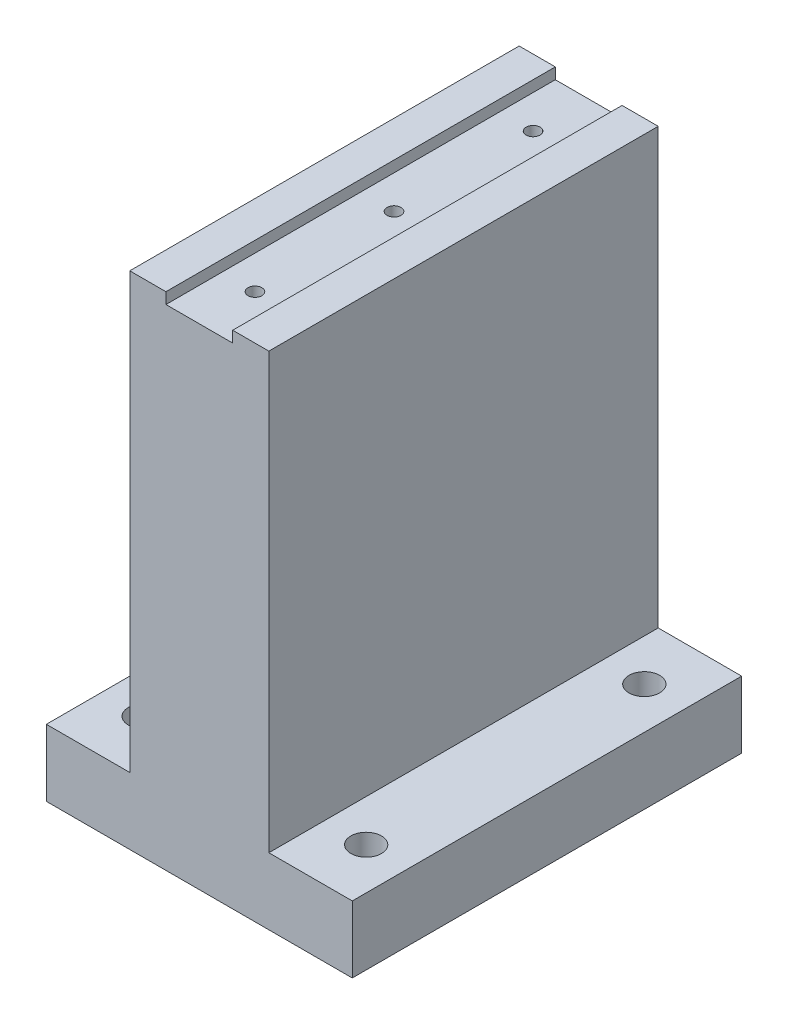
ISO-10303-21;
HEADER;
FILE_DESCRIPTION(('STEP AP214'),'2;1');
FILE_NAME('part.step','',(''),(''),'','','');
FILE_SCHEMA(('AUTOMOTIVE_DESIGN { 1 0 10303 214 1 1 1 1 }'));
ENDSEC;
DATA;
#1=APPLICATION_CONTEXT('core data for automotive mechanical design processes');
#2=APPLICATION_PROTOCOL_DEFINITION('international standard','automotive_design',2000,#1);
#3=PRODUCT_CONTEXT('',#1,'mechanical');
#4=PRODUCT('Part','Part','',(#3));
#5=PRODUCT_RELATED_PRODUCT_CATEGORY('part','',(#4));
#6=PRODUCT_DEFINITION_FORMATION('','',#4);
#7=PRODUCT_DEFINITION_CONTEXT('part definition',#1,'design');
#8=PRODUCT_DEFINITION('design','',#6,#7);
#9=PRODUCT_DEFINITION_SHAPE('','',#8);
#10=(LENGTH_UNIT() NAMED_UNIT(*) SI_UNIT(.MILLI.,.METRE.));
#11=(NAMED_UNIT(*) PLANE_ANGLE_UNIT() SI_UNIT($,.RADIAN.));
#12=(NAMED_UNIT(*) SI_UNIT($,.STERADIAN.) SOLID_ANGLE_UNIT());
#13=UNCERTAINTY_MEASURE_WITH_UNIT(LENGTH_MEASURE(1.E-05),#10,'distance_accuracy_value','');
#14=(GEOMETRIC_REPRESENTATION_CONTEXT(3) GLOBAL_UNCERTAINTY_ASSIGNED_CONTEXT((#13)) GLOBAL_UNIT_ASSIGNED_CONTEXT((#10,
#11,#12)) REPRESENTATION_CONTEXT('',''));
#15=CARTESIAN_POINT('',(0.,0.,0.));
#16=DIRECTION('',(0.,0.,1.));
#17=DIRECTION('',(1.,0.,0.));
#18=AXIS2_PLACEMENT_3D('',#15,#16,#17);
#19=CARTESIAN_POINT('',(21.5,88.1000000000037,70.));
#20=DIRECTION('',(0.,-1.,0.));
#21=DIRECTION('',(0.,0.,-1.));
#22=AXIS2_PLACEMENT_3D('',#19,#20,#21);
#23=PLANE('',#22);
#24=CARTESIAN_POINT('',(27.5,88.1000000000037,60.));
#25=DIRECTION('',(0.,1.,0.));
#26=DIRECTION('',(0.,0.,1.));
#27=AXIS2_PLACEMENT_3D('',#24,#25,#26);
#28=CIRCLE('',#27,1.25);
#29=CARTESIAN_POINT('',(27.5,88.1000000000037,61.25));
#30=VERTEX_POINT('',#29);
#31=EDGE_CURVE('E264',#30,#30,#28,.T.);
#32=ORIENTED_EDGE('',*,*,#31,.F.);
#33=EDGE_LOOP('',(#32));
#34=FACE_BOUND('',#33,.T.);
#35=CARTESIAN_POINT('',(27.5,88.1000000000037,35.));
#36=DIRECTION('',(0.,1.,0.));
#37=DIRECTION('',(0.,0.,1.));
#38=AXIS2_PLACEMENT_3D('',#35,#36,#37);
#39=CIRCLE('',#38,1.25);
#40=CARTESIAN_POINT('',(27.5,88.1000000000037,36.25));
#41=VERTEX_POINT('',#40);
#42=EDGE_CURVE('E268',#41,#41,#39,.T.);
#43=ORIENTED_EDGE('',*,*,#42,.F.);
#44=EDGE_LOOP('',(#43));
#45=FACE_BOUND('',#44,.T.);
#46=CARTESIAN_POINT('',(27.5,88.1000000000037,10.));
#47=DIRECTION('',(0.,1.,0.));
#48=DIRECTION('',(0.,0.,1.));
#49=AXIS2_PLACEMENT_3D('',#46,#47,#48);
#50=CIRCLE('',#49,1.25);
#51=CARTESIAN_POINT('',(27.5,88.1000000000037,11.25));
#52=VERTEX_POINT('',#51);
#53=EDGE_CURVE('E271',#52,#52,#50,.T.);
#54=ORIENTED_EDGE('',*,*,#53,.F.);
#55=EDGE_LOOP('',(#54));
#56=FACE_BOUND('',#55,.T.);
#57=DIRECTION('',(-1.,0.,0.));
#58=VECTOR('',#57,1.);
#59=CARTESIAN_POINT('',(21.5,88.1000000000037,0.));
#60=LINE('',#59,#58);
#61=CARTESIAN_POINT('',(33.5,88.1000000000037,0.));
#62=VERTEX_POINT('',#61);
#63=CARTESIAN_POINT('',(21.5,88.1000000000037,0.));
#64=VERTEX_POINT('',#63);
#65=EDGE_CURVE('E154',#62,#64,#60,.T.);
#66=ORIENTED_EDGE('',*,*,#65,.T.);
#67=DIRECTION('',(0.,0.,-1.));
#68=VECTOR('',#67,1.);
#69=CARTESIAN_POINT('',(21.5,88.1000000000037,70.));
#70=LINE('',#69,#68);
#71=CARTESIAN_POINT('',(21.5,88.1000000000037,70.));
#72=VERTEX_POINT('',#71);
#73=EDGE_CURVE('E11',#72,#64,#70,.T.);
#74=ORIENTED_EDGE('',*,*,#73,.F.);
#75=DIRECTION('',(-1.,0.,0.));
#76=VECTOR('',#75,1.);
#77=CARTESIAN_POINT('',(21.5,88.1000000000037,70.));
#78=LINE('',#77,#76);
#79=CARTESIAN_POINT('',(33.5,88.1000000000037,70.));
#80=VERTEX_POINT('',#79);
#81=EDGE_CURVE('E177',#80,#72,#78,.T.);
#82=ORIENTED_EDGE('',*,*,#81,.F.);
#83=DIRECTION('',(0.,0.,-1.));
#84=VECTOR('',#83,1.);
#85=CARTESIAN_POINT('',(33.5,88.1000000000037,70.));
#86=LINE('',#85,#84);
#87=EDGE_CURVE('E150',#80,#62,#86,.T.);
#88=ORIENTED_EDGE('',*,*,#87,.T.);
#89=EDGE_LOOP('',(#66,#74,#82,#88));
#90=FACE_BOUND('',#89,.T.);
#91=ADVANCED_FACE('F32',(#34,#45,#56,#90),#23,.F.);
#92=CARTESIAN_POINT('',(21.5,88.1000000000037,70.));
#93=DIRECTION('',(-1.,0.,0.));
#94=DIRECTION('',(0.,0.,1.));
#95=AXIS2_PLACEMENT_3D('',#92,#93,#94);
#96=PLANE('',#95);
#97=DIRECTION('',(0.,1.,0.));
#98=VECTOR('',#97,1.);
#99=CARTESIAN_POINT('',(21.5,88.1000000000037,0.));
#100=LINE('',#99,#98);
#101=CARTESIAN_POINT('',(21.5,90.1000000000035,0.));
#102=VERTEX_POINT('',#101);
#103=EDGE_CURVE('E157',#64,#102,#100,.T.);
#104=ORIENTED_EDGE('',*,*,#103,.T.);
#105=DIRECTION('',(0.,0.,-1.));
#106=VECTOR('',#105,1.);
#107=CARTESIAN_POINT('',(21.5,90.1000000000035,70.));
#108=LINE('',#107,#106);
#109=CARTESIAN_POINT('',(21.5,90.1000000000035,70.));
#110=VERTEX_POINT('',#109);
#111=EDGE_CURVE('E41',#110,#102,#108,.T.);
#112=ORIENTED_EDGE('',*,*,#111,.F.);
#113=DIRECTION('',(0.,1.,0.));
#114=VECTOR('',#113,1.);
#115=CARTESIAN_POINT('',(21.5,88.1000000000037,70.));
#116=LINE('',#115,#114);
#117=EDGE_CURVE('E105',#72,#110,#116,.T.);
#118=ORIENTED_EDGE('',*,*,#117,.F.);
#119=ORIENTED_EDGE('',*,*,#73,.T.);
#120=EDGE_LOOP('',(#104,#112,#118,#119));
#121=FACE_BOUND('',#120,.T.);
#122=ADVANCED_FACE('F255',(#121),#96,.F.);
#123=CARTESIAN_POINT('',(15.,90.1000000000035,70.));
#124=DIRECTION('',(0.,-1.,0.));
#125=DIRECTION('',(0.,0.,-1.));
#126=AXIS2_PLACEMENT_3D('',#123,#124,#125);
#127=PLANE('',#126);
#128=DIRECTION('',(-1.,0.,0.));
#129=VECTOR('',#128,1.);
#130=CARTESIAN_POINT('',(15.,90.1000000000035,0.));
#131=LINE('',#130,#129);
#132=CARTESIAN_POINT('',(15.,90.1000000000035,0.));
#133=VERTEX_POINT('',#132);
#134=EDGE_CURVE('E160',#102,#133,#131,.T.);
#135=ORIENTED_EDGE('',*,*,#134,.T.);
#136=DIRECTION('',(0.,0.,-1.));
#137=VECTOR('',#136,1.);
#138=CARTESIAN_POINT('',(15.,90.1000000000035,70.));
#139=LINE('',#138,#137);
#140=CARTESIAN_POINT('',(15.,90.1000000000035,70.));
#141=VERTEX_POINT('',#140);
#142=EDGE_CURVE('E196',#141,#133,#139,.T.);
#143=ORIENTED_EDGE('',*,*,#142,.F.);
#144=DIRECTION('',(-1.,0.,0.));
#145=VECTOR('',#144,1.);
#146=CARTESIAN_POINT('',(15.,90.1000000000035,70.));
#147=LINE('',#146,#145);
#148=EDGE_CURVE('E216',#110,#141,#147,.T.);
#149=ORIENTED_EDGE('',*,*,#148,.F.);
#150=ORIENTED_EDGE('',*,*,#111,.T.);
#151=EDGE_LOOP('',(#135,#143,#149,#150));
#152=FACE_BOUND('',#151,.T.);
#153=ADVANCED_FACE('F260',(#152),#127,.F.);
#154=CARTESIAN_POINT('',(15.,12.,70.));
#155=DIRECTION('',(1.,0.,0.));
#156=DIRECTION('',(0.,0.,-1.));
#157=AXIS2_PLACEMENT_3D('',#154,#155,#156);
#158=PLANE('',#157);
#159=DIRECTION('',(0.,-1.,0.));
#160=VECTOR('',#159,1.);
#161=CARTESIAN_POINT('',(15.,12.,0.));
#162=LINE('',#161,#160);
#163=CARTESIAN_POINT('',(15.,12.,0.));
#164=VERTEX_POINT('',#163);
#165=EDGE_CURVE('E162',#133,#164,#162,.T.);
#166=ORIENTED_EDGE('',*,*,#165,.T.);
#167=DIRECTION('',(0.,0.,-1.));
#168=VECTOR('',#167,1.);
#169=CARTESIAN_POINT('',(15.,12.,70.));
#170=LINE('',#169,#168);
#171=CARTESIAN_POINT('',(15.,12.,70.));
#172=VERTEX_POINT('',#171);
#173=EDGE_CURVE('E193',#172,#164,#170,.T.);
#174=ORIENTED_EDGE('',*,*,#173,.F.);
#175=DIRECTION('',(0.,-1.,0.));
#176=VECTOR('',#175,1.);
#177=CARTESIAN_POINT('',(15.,12.,70.));
#178=LINE('',#177,#176);
#179=EDGE_CURVE('E218',#141,#172,#178,.T.);
#180=ORIENTED_EDGE('',*,*,#179,.F.);
#181=ORIENTED_EDGE('',*,*,#142,.T.);
#182=EDGE_LOOP('',(#166,#174,#180,#181));
#183=FACE_BOUND('',#182,.T.);
#184=ADVANCED_FACE('F318',(#183),#158,.F.);
#185=CARTESIAN_POINT('',(0.,12.,70.));
#186=DIRECTION('',(0.,-1.,0.));
#187=DIRECTION('',(0.,0.,-1.));
#188=AXIS2_PLACEMENT_3D('',#185,#186,#187);
#189=PLANE('',#188);
#190=CARTESIAN_POINT('',(7.5,12.,60.));
#191=DIRECTION('',(0.,1.,0.));
#192=DIRECTION('',(0.,0.,1.));
#193=AXIS2_PLACEMENT_3D('',#190,#191,#192);
#194=CIRCLE('',#193,2.75);
#195=CARTESIAN_POINT('',(7.5,12.,62.75));
#196=VERTEX_POINT('',#195);
#197=EDGE_CURVE('E277',#196,#196,#194,.T.);
#198=ORIENTED_EDGE('',*,*,#197,.F.);
#199=EDGE_LOOP('',(#198));
#200=FACE_BOUND('',#199,.T.);
#201=CARTESIAN_POINT('',(7.5,12.,10.));
#202=DIRECTION('',(0.,1.,0.));
#203=DIRECTION('',(0.,0.,1.));
#204=AXIS2_PLACEMENT_3D('',#201,#202,#203);
#205=CIRCLE('',#204,2.75);
#206=CARTESIAN_POINT('',(7.5,12.,12.75));
#207=VERTEX_POINT('',#206);
#208=EDGE_CURVE('E201',#207,#207,#205,.T.);
#209=ORIENTED_EDGE('',*,*,#208,.F.);
#210=EDGE_LOOP('',(#209));
#211=FACE_BOUND('',#210,.T.);
#212=DIRECTION('',(-1.,0.,0.));
#213=VECTOR('',#212,1.);
#214=CARTESIAN_POINT('',(0.,12.,0.));
#215=LINE('',#214,#213);
#216=CARTESIAN_POINT('',(0.,12.,0.));
#217=VERTEX_POINT('',#216);
#218=EDGE_CURVE('E164',#164,#217,#215,.T.);
#219=ORIENTED_EDGE('',*,*,#218,.T.);
#220=DIRECTION('',(0.,0.,-1.));
#221=VECTOR('',#220,1.);
#222=CARTESIAN_POINT('',(0.,12.,70.));
#223=LINE('',#222,#221);
#224=CARTESIAN_POINT('',(0.,12.,70.));
#225=VERTEX_POINT('',#224);
#226=EDGE_CURVE('E190',#225,#217,#223,.T.);
#227=ORIENTED_EDGE('',*,*,#226,.F.);
#228=DIRECTION('',(-1.,0.,0.));
#229=VECTOR('',#228,1.);
#230=CARTESIAN_POINT('',(0.,12.,70.));
#231=LINE('',#230,#229);
#232=EDGE_CURVE('E220',#172,#225,#231,.T.);
#233=ORIENTED_EDGE('',*,*,#232,.F.);
#234=ORIENTED_EDGE('',*,*,#173,.T.);
#235=EDGE_LOOP('',(#219,#227,#233,#234));
#236=FACE_BOUND('',#235,.T.);
#237=ADVANCED_FACE('F314',(#200,#211,#236),#189,.F.);
#238=CARTESIAN_POINT('',(0.,0.,70.));
#239=DIRECTION('',(1.,0.,0.));
#240=DIRECTION('',(0.,0.,-1.));
#241=AXIS2_PLACEMENT_3D('',#238,#239,#240);
#242=PLANE('',#241);
#243=DIRECTION('',(0.,-1.,0.));
#244=VECTOR('',#243,1.);
#245=CARTESIAN_POINT('',(0.,0.,0.));
#246=LINE('',#245,#244);
#247=CARTESIAN_POINT('',(0.,0.,0.));
#248=VERTEX_POINT('',#247);
#249=EDGE_CURVE('E166',#217,#248,#246,.T.);
#250=ORIENTED_EDGE('',*,*,#249,.T.);
#251=DIRECTION('',(0.,0.,-1.));
#252=VECTOR('',#251,1.);
#253=CARTESIAN_POINT('',(0.,0.,70.));
#254=LINE('',#253,#252);
#255=CARTESIAN_POINT('',(0.,0.,70.));
#256=VERTEX_POINT('',#255);
#257=EDGE_CURVE('E187',#256,#248,#254,.T.);
#258=ORIENTED_EDGE('',*,*,#257,.F.);
#259=DIRECTION('',(0.,-1.,0.));
#260=VECTOR('',#259,1.);
#261=CARTESIAN_POINT('',(0.,0.,70.));
#262=LINE('',#261,#260);
#263=EDGE_CURVE('E222',#225,#256,#262,.T.);
#264=ORIENTED_EDGE('',*,*,#263,.F.);
#265=ORIENTED_EDGE('',*,*,#226,.T.);
#266=EDGE_LOOP('',(#250,#258,#264,#265));
#267=FACE_BOUND('',#266,.T.);
#268=ADVANCED_FACE('F310',(#267),#242,.F.);
#269=CARTESIAN_POINT('',(0.,0.,70.));
#270=DIRECTION('',(0.,1.,0.));
#271=DIRECTION('',(0.,0.,1.));
#272=AXIS2_PLACEMENT_3D('',#269,#270,#271);
#273=PLANE('',#272);
#274=CARTESIAN_POINT('',(7.5,0.,60.));
#275=DIRECTION('',(0.,1.,0.));
#276=DIRECTION('',(0.,0.,1.));
#277=AXIS2_PLACEMENT_3D('',#274,#275,#276);
#278=CIRCLE('',#277,2.75);
#279=CARTESIAN_POINT('',(7.5,0.,62.75));
#280=VERTEX_POINT('',#279);
#281=EDGE_CURVE('E35',#280,#280,#278,.T.);
#282=ORIENTED_EDGE('',*,*,#281,.T.);
#283=EDGE_LOOP('',(#282));
#284=FACE_BOUND('',#283,.T.);
#285=CARTESIAN_POINT('',(47.5,0.,60.));
#286=DIRECTION('',(0.,1.,0.));
#287=DIRECTION('',(0.,0.,1.));
#288=AXIS2_PLACEMENT_3D('',#285,#286,#287);
#289=CIRCLE('',#288,2.75);
#290=CARTESIAN_POINT('',(47.5,0.,62.75));
#291=VERTEX_POINT('',#290);
#292=EDGE_CURVE('E288',#291,#291,#289,.T.);
#293=ORIENTED_EDGE('',*,*,#292,.T.);
#294=EDGE_LOOP('',(#293));
#295=FACE_BOUND('',#294,.T.);
#296=CARTESIAN_POINT('',(47.5,0.,10.));
#297=DIRECTION('',(0.,1.,0.));
#298=DIRECTION('',(0.,0.,1.));
#299=AXIS2_PLACEMENT_3D('',#296,#297,#298);
#300=CIRCLE('',#299,2.75);
#301=CARTESIAN_POINT('',(47.5,0.,12.75));
#302=VERTEX_POINT('',#301);
#303=EDGE_CURVE('E205',#302,#302,#300,.T.);
#304=ORIENTED_EDGE('',*,*,#303,.T.);
#305=EDGE_LOOP('',(#304));
#306=FACE_BOUND('',#305,.T.);
#307=CARTESIAN_POINT('',(7.5,0.,10.));
#308=DIRECTION('',(0.,1.,0.));
#309=DIRECTION('',(0.,0.,1.));
#310=AXIS2_PLACEMENT_3D('',#307,#308,#309);
#311=CIRCLE('',#310,2.75);
#312=CARTESIAN_POINT('',(7.5,0.,12.75));
#313=VERTEX_POINT('',#312);
#314=EDGE_CURVE('E158',#313,#313,#311,.T.);
#315=ORIENTED_EDGE('',*,*,#314,.T.);
#316=EDGE_LOOP('',(#315));
#317=FACE_BOUND('',#316,.T.);
#318=DIRECTION('',(1.,0.,0.));
#319=VECTOR('',#318,1.);
#320=CARTESIAN_POINT('',(0.,0.,0.));
#321=LINE('',#320,#319);
#322=CARTESIAN_POINT('',(55.,0.,0.));
#323=VERTEX_POINT('',#322);
#324=EDGE_CURVE('E168',#248,#323,#321,.T.);
#325=ORIENTED_EDGE('',*,*,#324,.T.);
#326=DIRECTION('',(0.,0.,-1.));
#327=VECTOR('',#326,1.);
#328=CARTESIAN_POINT('',(55.,0.,70.));
#329=LINE('',#328,#327);
#330=CARTESIAN_POINT('',(55.,0.,70.));
#331=VERTEX_POINT('',#330);
#332=EDGE_CURVE('E184',#331,#323,#329,.T.);
#333=ORIENTED_EDGE('',*,*,#332,.F.);
#334=DIRECTION('',(1.,0.,0.));
#335=VECTOR('',#334,1.);
#336=CARTESIAN_POINT('',(0.,0.,70.));
#337=LINE('',#336,#335);
#338=EDGE_CURVE('E224',#256,#331,#337,.T.);
#339=ORIENTED_EDGE('',*,*,#338,.F.);
#340=ORIENTED_EDGE('',*,*,#257,.T.);
#341=EDGE_LOOP('',(#325,#333,#339,#340));
#342=FACE_BOUND('',#341,.T.);
#343=ADVANCED_FACE('F304',(#284,#295,#306,#317,#342),#273,.F.);
#344=CARTESIAN_POINT('',(55.,0.,70.));
#345=DIRECTION('',(-1.,0.,0.));
#346=DIRECTION('',(0.,0.,1.));
#347=AXIS2_PLACEMENT_3D('',#344,#345,#346);
#348=PLANE('',#347);
#349=DIRECTION('',(0.,1.,0.));
#350=VECTOR('',#349,1.);
#351=CARTESIAN_POINT('',(55.,0.,0.));
#352=LINE('',#351,#350);
#353=CARTESIAN_POINT('',(55.,12.,0.));
#354=VERTEX_POINT('',#353);
#355=EDGE_CURVE('E170',#323,#354,#352,.T.);
#356=ORIENTED_EDGE('',*,*,#355,.T.);
#357=DIRECTION('',(0.,0.,-1.));
#358=VECTOR('',#357,1.);
#359=CARTESIAN_POINT('',(55.,12.,70.));
#360=LINE('',#359,#358);
#361=CARTESIAN_POINT('',(55.,12.,70.));
#362=VERTEX_POINT('',#361);
#363=EDGE_CURVE('E181',#362,#354,#360,.T.);
#364=ORIENTED_EDGE('',*,*,#363,.F.);
#365=DIRECTION('',(0.,1.,0.));
#366=VECTOR('',#365,1.);
#367=CARTESIAN_POINT('',(55.,0.,70.));
#368=LINE('',#367,#366);
#369=EDGE_CURVE('E226',#331,#362,#368,.T.);
#370=ORIENTED_EDGE('',*,*,#369,.F.);
#371=ORIENTED_EDGE('',*,*,#332,.T.);
#372=EDGE_LOOP('',(#356,#364,#370,#371));
#373=FACE_BOUND('',#372,.T.);
#374=ADVANCED_FACE('F232',(#373),#348,.F.);
#375=CARTESIAN_POINT('',(40.,12.,70.));
#376=DIRECTION('',(0.,-1.,0.));
#377=DIRECTION('',(0.,0.,-1.));
#378=AXIS2_PLACEMENT_3D('',#375,#376,#377);
#379=PLANE('',#378);
#380=CARTESIAN_POINT('',(47.5,12.,60.));
#381=DIRECTION('',(0.,1.,0.));
#382=DIRECTION('',(0.,0.,1.));
#383=AXIS2_PLACEMENT_3D('',#380,#381,#382);
#384=CIRCLE('',#383,2.75);
#385=CARTESIAN_POINT('',(47.5,12.,62.75));
#386=VERTEX_POINT('',#385);
#387=EDGE_CURVE('E285',#386,#386,#384,.T.);
#388=ORIENTED_EDGE('',*,*,#387,.F.);
#389=EDGE_LOOP('',(#388));
#390=FACE_BOUND('',#389,.T.);
#391=CARTESIAN_POINT('',(47.5,12.,10.));
#392=DIRECTION('',(0.,1.,0.));
#393=DIRECTION('',(0.,0.,1.));
#394=AXIS2_PLACEMENT_3D('',#391,#392,#393);
#395=CIRCLE('',#394,2.75);
#396=CARTESIAN_POINT('',(47.5,12.,12.75));
#397=VERTEX_POINT('',#396);
#398=EDGE_CURVE('E210',#397,#397,#395,.T.);
#399=ORIENTED_EDGE('',*,*,#398,.F.);
#400=EDGE_LOOP('',(#399));
#401=FACE_BOUND('',#400,.T.);
#402=DIRECTION('',(-1.,0.,0.));
#403=VECTOR('',#402,1.);
#404=CARTESIAN_POINT('',(40.,12.,0.));
#405=LINE('',#404,#403);
#406=CARTESIAN_POINT('',(40.,12.,0.));
#407=VERTEX_POINT('',#406);
#408=EDGE_CURVE('E172',#354,#407,#405,.T.);
#409=ORIENTED_EDGE('',*,*,#408,.T.);
#410=DIRECTION('',(0.,0.,-1.));
#411=VECTOR('',#410,1.);
#412=CARTESIAN_POINT('',(40.,12.,70.));
#413=LINE('',#412,#411);
#414=CARTESIAN_POINT('',(40.,12.,70.));
#415=VERTEX_POINT('',#414);
#416=EDGE_CURVE('E145',#415,#407,#413,.T.);
#417=ORIENTED_EDGE('',*,*,#416,.F.);
#418=DIRECTION('',(-1.,0.,0.));
#419=VECTOR('',#418,1.);
#420=CARTESIAN_POINT('',(40.,12.,70.));
#421=LINE('',#420,#419);
#422=EDGE_CURVE('E136',#362,#415,#421,.T.);
#423=ORIENTED_EDGE('',*,*,#422,.F.);
#424=ORIENTED_EDGE('',*,*,#363,.T.);
#425=EDGE_LOOP('',(#409,#417,#423,#424));
#426=FACE_BOUND('',#425,.T.);
#427=ADVANCED_FACE('F236',(#390,#401,#426),#379,.F.);
#428=CARTESIAN_POINT('',(40.,12.,70.));
#429=DIRECTION('',(-1.,0.,0.));
#430=DIRECTION('',(0.,0.,1.));
#431=AXIS2_PLACEMENT_3D('',#428,#429,#430);
#432=PLANE('',#431);
#433=DIRECTION('',(0.,1.,0.));
#434=VECTOR('',#433,1.);
#435=CARTESIAN_POINT('',(40.,12.,0.));
#436=LINE('',#435,#434);
#437=CARTESIAN_POINT('',(40.,90.1000000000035,0.));
#438=VERTEX_POINT('',#437);
#439=EDGE_CURVE('E144',#407,#438,#436,.T.);
#440=ORIENTED_EDGE('',*,*,#439,.T.);
#441=DIRECTION('',(0.,0.,-1.));
#442=VECTOR('',#441,1.);
#443=CARTESIAN_POINT('',(40.,90.1000000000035,70.));
#444=LINE('',#443,#442);
#445=CARTESIAN_POINT('',(40.,90.1000000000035,70.));
#446=VERTEX_POINT('',#445);
#447=EDGE_CURVE('E141',#446,#438,#444,.T.);
#448=ORIENTED_EDGE('',*,*,#447,.F.);
#449=DIRECTION('',(0.,1.,0.));
#450=VECTOR('',#449,1.);
#451=CARTESIAN_POINT('',(40.,12.,70.));
#452=LINE('',#451,#450);
#453=EDGE_CURVE('E130',#415,#446,#452,.T.);
#454=ORIENTED_EDGE('',*,*,#453,.F.);
#455=ORIENTED_EDGE('',*,*,#416,.T.);
#456=EDGE_LOOP('',(#440,#448,#454,#455));
#457=FACE_BOUND('',#456,.T.);
#458=ADVANCED_FACE('F142',(#457),#432,.F.);
#459=CARTESIAN_POINT('',(33.5,90.1000000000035,70.));
#460=DIRECTION('',(0.,-1.,0.));
#461=DIRECTION('',(0.,0.,-1.));
#462=AXIS2_PLACEMENT_3D('',#459,#460,#461);
#463=PLANE('',#462);
#464=DIRECTION('',(-1.,0.,0.));
#465=VECTOR('',#464,1.);
#466=CARTESIAN_POINT('',(33.5,90.1000000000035,0.));
#467=LINE('',#466,#465);
#468=CARTESIAN_POINT('',(33.5,90.1000000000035,0.));
#469=VERTEX_POINT('',#468);
#470=EDGE_CURVE('E91',#438,#469,#467,.T.);
#471=ORIENTED_EDGE('',*,*,#470,.T.);
#472=DIRECTION('',(0.,0.,-1.));
#473=VECTOR('',#472,1.);
#474=CARTESIAN_POINT('',(33.5,90.1000000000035,70.));
#475=LINE('',#474,#473);
#476=CARTESIAN_POINT('',(33.5,90.1000000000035,70.));
#477=VERTEX_POINT('',#476);
#478=EDGE_CURVE('E146',#477,#469,#475,.T.);
#479=ORIENTED_EDGE('',*,*,#478,.F.);
#480=DIRECTION('',(-1.,0.,0.));
#481=VECTOR('',#480,1.);
#482=CARTESIAN_POINT('',(33.5,90.1000000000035,70.));
#483=LINE('',#482,#481);
#484=EDGE_CURVE('E134',#446,#477,#483,.T.);
#485=ORIENTED_EDGE('',*,*,#484,.F.);
#486=ORIENTED_EDGE('',*,*,#447,.T.);
#487=EDGE_LOOP('',(#471,#479,#485,#486));
#488=FACE_BOUND('',#487,.T.);
#489=ADVANCED_FACE('F148',(#488),#463,.F.);
#490=CARTESIAN_POINT('',(33.5,88.1000000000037,70.));
#491=DIRECTION('',(1.,0.,0.));
#492=DIRECTION('',(0.,0.,-1.));
#493=AXIS2_PLACEMENT_3D('',#490,#491,#492);
#494=PLANE('',#493);
#495=DIRECTION('',(0.,-1.,0.));
#496=VECTOR('',#495,1.);
#497=CARTESIAN_POINT('',(33.5,88.1000000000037,0.));
#498=LINE('',#497,#496);
#499=EDGE_CURVE('E97',#469,#62,#498,.T.);
#500=ORIENTED_EDGE('',*,*,#499,.T.);
#501=ORIENTED_EDGE('',*,*,#87,.F.);
#502=DIRECTION('',(0.,-1.,0.));
#503=VECTOR('',#502,1.);
#504=CARTESIAN_POINT('',(33.5,88.1000000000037,70.));
#505=LINE('',#504,#503);
#506=EDGE_CURVE('E50',#477,#80,#505,.T.);
#507=ORIENTED_EDGE('',*,*,#506,.F.);
#508=ORIENTED_EDGE('',*,*,#478,.T.);
#509=EDGE_LOOP('',(#500,#501,#507,#508));
#510=FACE_BOUND('',#509,.T.);
#511=ADVANCED_FACE('F244',(#510),#494,.F.);
#512=CARTESIAN_POINT('',(33.5,88.1000000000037,70.));
#513=DIRECTION('',(0.,0.,1.));
#514=DIRECTION('',(1.,0.,0.));
#515=AXIS2_PLACEMENT_3D('',#512,#513,#514);
#516=PLANE('',#515);
#517=ORIENTED_EDGE('',*,*,#81,.T.);
#518=ORIENTED_EDGE('',*,*,#117,.T.);
#519=ORIENTED_EDGE('',*,*,#148,.T.);
#520=ORIENTED_EDGE('',*,*,#179,.T.);
#521=ORIENTED_EDGE('',*,*,#232,.T.);
#522=ORIENTED_EDGE('',*,*,#263,.T.);
#523=ORIENTED_EDGE('',*,*,#338,.T.);
#524=ORIENTED_EDGE('',*,*,#369,.T.);
#525=ORIENTED_EDGE('',*,*,#422,.T.);
#526=ORIENTED_EDGE('',*,*,#453,.T.);
#527=ORIENTED_EDGE('',*,*,#484,.T.);
#528=ORIENTED_EDGE('',*,*,#506,.T.);
#529=EDGE_LOOP('',(#517,#518,#519,#520,#521,#522,#523,#524,#525,#526,#527,#528));
#530=FACE_BOUND('',#529,.T.);
#531=ADVANCED_FACE('F132',(#530),#516,.T.);
#532=CARTESIAN_POINT('',(33.5,88.1000000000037,0.));
#533=DIRECTION('',(0.,0.,1.));
#534=DIRECTION('',(1.,0.,0.));
#535=AXIS2_PLACEMENT_3D('',#532,#533,#534);
#536=PLANE('',#535);
#537=ORIENTED_EDGE('',*,*,#65,.F.);
#538=ORIENTED_EDGE('',*,*,#499,.F.);
#539=ORIENTED_EDGE('',*,*,#470,.F.);
#540=ORIENTED_EDGE('',*,*,#439,.F.);
#541=ORIENTED_EDGE('',*,*,#408,.F.);
#542=ORIENTED_EDGE('',*,*,#355,.F.);
#543=ORIENTED_EDGE('',*,*,#324,.F.);
#544=ORIENTED_EDGE('',*,*,#249,.F.);
#545=ORIENTED_EDGE('',*,*,#218,.F.);
#546=ORIENTED_EDGE('',*,*,#165,.F.);
#547=ORIENTED_EDGE('',*,*,#134,.F.);
#548=ORIENTED_EDGE('',*,*,#103,.F.);
#549=EDGE_LOOP('',(#537,#538,#539,#540,#541,#542,#543,#544,#545,#546,#547,#548));
#550=FACE_BOUND('',#549,.T.);
#551=ADVANCED_FACE('F239',(#550),#536,.F.);
#552=CARTESIAN_POINT('',(7.5,-58.,10.));
#553=DIRECTION('',(0.,1.,0.));
#554=DIRECTION('',(0.,0.,1.));
#555=AXIS2_PLACEMENT_3D('',#552,#553,#554);
#556=CYLINDRICAL_SURFACE('',#555,2.75);
#557=ORIENTED_EDGE('',*,*,#208,.T.);
#558=EDGE_LOOP('',(#557));
#559=FACE_BOUND('',#558,.T.);
#560=ORIENTED_EDGE('',*,*,#314,.F.);
#561=EDGE_LOOP('',(#560));
#562=FACE_BOUND('',#561,.T.);
#563=ADVANCED_FACE('F394',(#559,#562),#556,.F.);
#564=CARTESIAN_POINT('',(47.5,-58.,10.));
#565=DIRECTION('',(0.,1.,0.));
#566=DIRECTION('',(0.,0.,1.));
#567=AXIS2_PLACEMENT_3D('',#564,#565,#566);
#568=CYLINDRICAL_SURFACE('',#567,2.75);
#569=ORIENTED_EDGE('',*,*,#398,.T.);
#570=EDGE_LOOP('',(#569));
#571=FACE_BOUND('',#570,.T.);
#572=ORIENTED_EDGE('',*,*,#303,.F.);
#573=EDGE_LOOP('',(#572));
#574=FACE_BOUND('',#573,.T.);
#575=ADVANCED_FACE('F293',(#571,#574),#568,.F.);
#576=CARTESIAN_POINT('',(47.5,-58.,60.));
#577=DIRECTION('',(0.,1.,0.));
#578=DIRECTION('',(0.,0.,1.));
#579=AXIS2_PLACEMENT_3D('',#576,#577,#578);
#580=CYLINDRICAL_SURFACE('',#579,2.75);
#581=ORIENTED_EDGE('',*,*,#387,.T.);
#582=EDGE_LOOP('',(#581));
#583=FACE_BOUND('',#582,.T.);
#584=ORIENTED_EDGE('',*,*,#292,.F.);
#585=EDGE_LOOP('',(#584));
#586=FACE_BOUND('',#585,.T.);
#587=ADVANCED_FACE('F408',(#583,#586),#580,.F.);
#588=CARTESIAN_POINT('',(7.5,-58.,60.));
#589=DIRECTION('',(0.,1.,0.));
#590=DIRECTION('',(0.,0.,1.));
#591=AXIS2_PLACEMENT_3D('',#588,#589,#590);
#592=CYLINDRICAL_SURFACE('',#591,2.75);
#593=ORIENTED_EDGE('',*,*,#197,.T.);
#594=EDGE_LOOP('',(#593));
#595=FACE_BOUND('',#594,.T.);
#596=ORIENTED_EDGE('',*,*,#281,.F.);
#597=EDGE_LOOP('',(#596));
#598=FACE_BOUND('',#597,.T.);
#599=ADVANCED_FACE('F415',(#595,#598),#592,.F.);
#600=CARTESIAN_POINT('',(27.5,73.1000000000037,10.));
#601=DIRECTION('',(0.,1.,0.));
#602=DIRECTION('',(0.,0.,1.));
#603=AXIS2_PLACEMENT_3D('',#600,#601,#602);
#604=CYLINDRICAL_SURFACE('',#603,1.25);
#605=CARTESIAN_POINT('',(27.5,73.1000000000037,10.));
#606=DIRECTION('',(0.,1.,0.));
#607=DIRECTION('',(0.,0.,1.));
#608=AXIS2_PLACEMENT_3D('',#605,#606,#607);
#609=CIRCLE('',#608,1.25);
#610=CARTESIAN_POINT('',(27.5,73.1000000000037,11.25));
#611=VERTEX_POINT('',#610);
#612=EDGE_CURVE('E273',#611,#611,#609,.T.);
#613=ORIENTED_EDGE('',*,*,#612,.F.);
#614=EDGE_LOOP('',(#613));
#615=FACE_BOUND('',#614,.T.);
#616=ORIENTED_EDGE('',*,*,#53,.T.);
#617=EDGE_LOOP('',(#616));
#618=FACE_BOUND('',#617,.T.);
#619=ADVANCED_FACE('F423',(#615,#618),#604,.F.);
#620=CARTESIAN_POINT('',(27.5,73.1000000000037,10.));
#621=DIRECTION('',(0.,1.,0.));
#622=DIRECTION('',(0.,0.,1.));
#623=AXIS2_PLACEMENT_3D('',#620,#621,#622);
#624=PLANE('',#623);
#625=ORIENTED_EDGE('',*,*,#612,.T.);
#626=EDGE_LOOP('',(#625));
#627=FACE_BOUND('',#626,.T.);
#628=ADVANCED_FACE('F431',(#627),#624,.T.);
#629=CARTESIAN_POINT('',(27.5,73.1000000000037,35.));
#630=DIRECTION('',(0.,1.,0.));
#631=DIRECTION('',(0.,0.,1.));
#632=AXIS2_PLACEMENT_3D('',#629,#630,#631);
#633=CYLINDRICAL_SURFACE('',#632,1.25);
#634=CARTESIAN_POINT('',(27.5,73.1000000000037,35.));
#635=DIRECTION('',(0.,1.,0.));
#636=DIRECTION('',(0.,0.,1.));
#637=AXIS2_PLACEMENT_3D('',#634,#635,#636);
#638=CIRCLE('',#637,1.25);
#639=CARTESIAN_POINT('',(27.5,73.1000000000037,36.25));
#640=VERTEX_POINT('',#639);
#641=EDGE_CURVE('E274',#640,#640,#638,.T.);
#642=ORIENTED_EDGE('',*,*,#641,.F.);
#643=EDGE_LOOP('',(#642));
#644=FACE_BOUND('',#643,.T.);
#645=ORIENTED_EDGE('',*,*,#42,.T.);
#646=EDGE_LOOP('',(#645));
#647=FACE_BOUND('',#646,.T.);
#648=ADVANCED_FACE('F439',(#644,#647),#633,.F.);
#649=CARTESIAN_POINT('',(27.5,73.1000000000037,35.));
#650=DIRECTION('',(0.,1.,0.));
#651=DIRECTION('',(0.,0.,1.));
#652=AXIS2_PLACEMENT_3D('',#649,#650,#651);
#653=PLANE('',#652);
#654=ORIENTED_EDGE('',*,*,#641,.T.);
#655=EDGE_LOOP('',(#654));
#656=FACE_BOUND('',#655,.T.);
#657=ADVANCED_FACE('F447',(#656),#653,.T.);
#658=CARTESIAN_POINT('',(27.5,73.1000000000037,60.));
#659=DIRECTION('',(0.,1.,0.));
#660=DIRECTION('',(0.,0.,1.));
#661=AXIS2_PLACEMENT_3D('',#658,#659,#660);
#662=CYLINDRICAL_SURFACE('',#661,1.25);
#663=CARTESIAN_POINT('',(27.5,73.1000000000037,60.));
#664=DIRECTION('',(0.,1.,0.));
#665=DIRECTION('',(0.,0.,1.));
#666=AXIS2_PLACEMENT_3D('',#663,#664,#665);
#667=CIRCLE('',#666,1.25);
#668=CARTESIAN_POINT('',(27.5,73.1000000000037,61.25));
#669=VERTEX_POINT('',#668);
#670=EDGE_CURVE('E496',#669,#669,#667,.T.);
#671=ORIENTED_EDGE('',*,*,#670,.F.);
#672=EDGE_LOOP('',(#671));
#673=FACE_BOUND('',#672,.T.);
#674=ORIENTED_EDGE('',*,*,#31,.T.);
#675=EDGE_LOOP('',(#674));
#676=FACE_BOUND('',#675,.T.);
#677=ADVANCED_FACE('F455',(#673,#676),#662,.F.);
#678=CARTESIAN_POINT('',(27.5,73.1000000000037,60.));
#679=DIRECTION('',(0.,1.,0.));
#680=DIRECTION('',(0.,0.,1.));
#681=AXIS2_PLACEMENT_3D('',#678,#679,#680);
#682=PLANE('',#681);
#683=ORIENTED_EDGE('',*,*,#670,.T.);
#684=EDGE_LOOP('',(#683));
#685=FACE_BOUND('',#684,.T.);
#686=ADVANCED_FACE('F463',(#685),#682,.T.);
#687=CLOSED_SHELL('',(#91,#122,#153,#184,#237,#268,#343,#374,#427,#458,#489,#511,#531,#551,#563,
#575,#587,#599,#619,#628,#648,#657,#677,#686));
#688=MANIFOLD_SOLID_BREP('B2',#687);
#689=ADVANCED_BREP_SHAPE_REPRESENTATION('',(#18,#688),#14);
#690=SHAPE_DEFINITION_REPRESENTATION(#9,#689);
ENDSEC;
END-ISO-10303-21;
